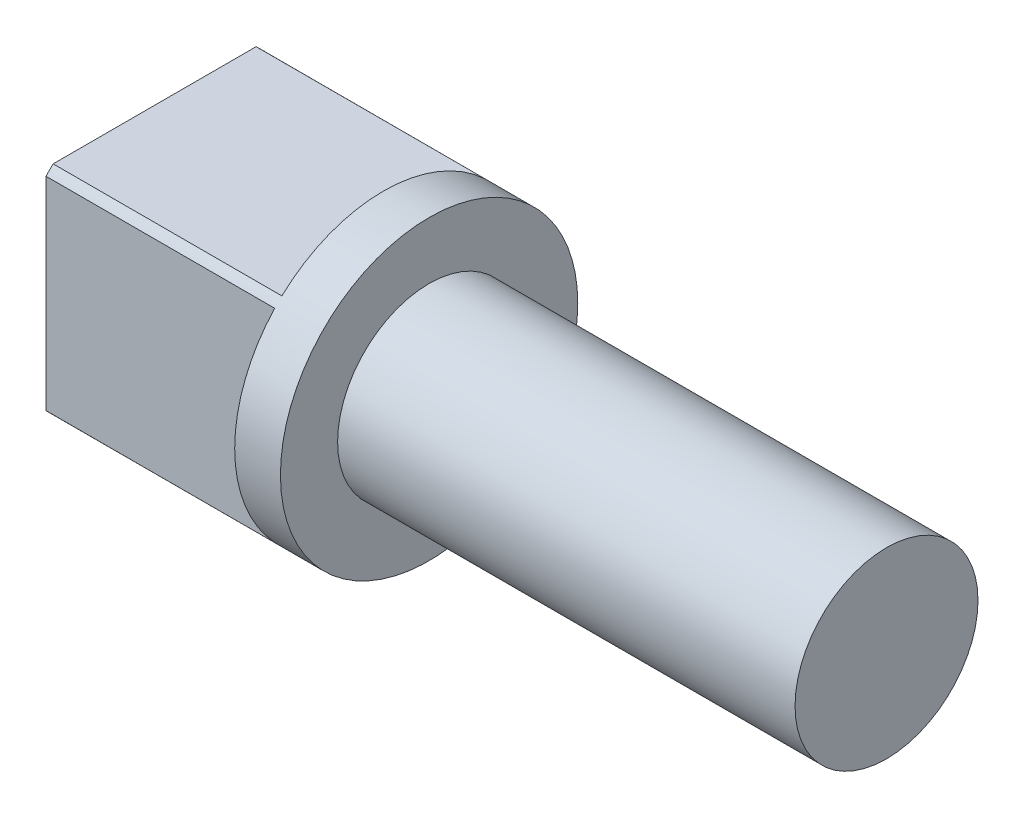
from build123d import *

# Parameters (mm, degrees)
SKETCH1_R           = 6.5
BOSS_EXTRUDE1_DEPTH = 2
SKETCH2_R           = 4
BOSS_EXTRUDE2_DEPTH = 20
BOSS_EXTRUDE3_START = 10
BOSS_EXTRUDE3_DEPTH = 10


with BuildPart() as part:
    # Sketch1 → Boss-Extrude1 (new body)
    with BuildSketch(Plane(origin=(0, 0, 0), x_dir=(0, 0, -1), z_dir=(1, 0, 0))):
        Circle(SKETCH1_R)
    extrude(amount=BOSS_EXTRUDE1_DEPTH)

    # Sketch2 → Boss-Extrude2 (add)
    with BuildSketch(Plane(origin=(2, 0, 0), x_dir=(0, 0, -1), z_dir=(1, 0, 0))):
        Circle(SKETCH2_R)
    extrude(amount=BOSS_EXTRUDE2_DEPTH)

    # Sketch3 → Boss-Extrude3 (add)
    with BuildSketch(Plane.ZY.offset(BOSS_EXTRUDE3_START)):
        with BuildLine():
            Line((4.437059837, -4.75), (-4.437059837, -4.75))
            ThreePointArc((-4.437059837, -4.75), (-4.596194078, -4.596194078), (-4.75, -4.437059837))
            Line((-4.75, -4.437059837), (-4.75, 4.437059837))
            ThreePointArc((-4.75, 4.437059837), (-4.596194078, 4.596194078), (-4.437059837, 4.75))
            Line((-4.437059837, 4.75), (4.437059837, 4.75))
            ThreePointArc((4.437059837, 4.75), (4.596194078, 4.596194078), (4.75, 4.437059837))
            Line((4.75, 4.437059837), (4.75, -4.437059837))
            ThreePointArc((4.75, -4.437059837), (4.596194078, -4.596194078), (4.437059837, -4.75))
        make_face()
    extrude(amount=-BOSS_EXTRUDE3_DEPTH)


solid = part.part
